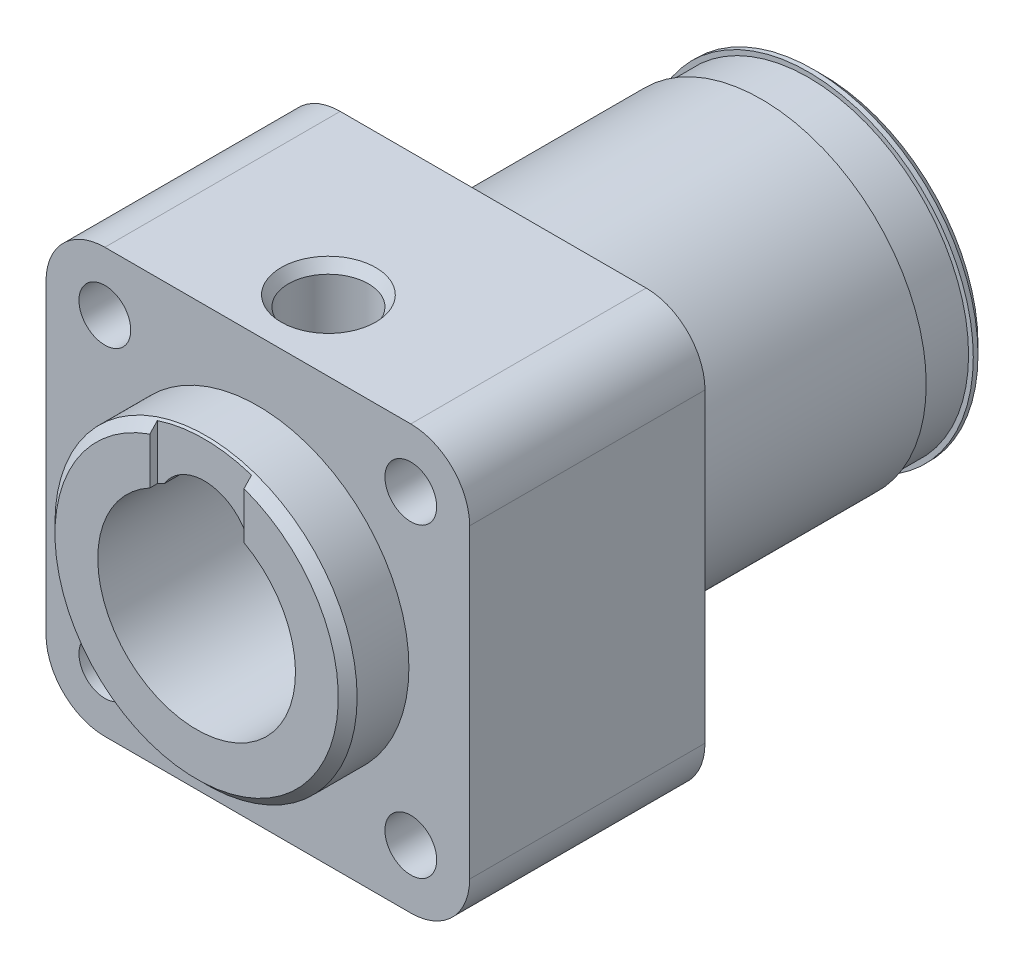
from build123d import *

# Parameters (mm, degrees)
ESQUISSE1_R                     = 30
BOSS_EXTRU_1_DEPTH              = 66.5
ESQUISSE2_W                     = 47.85022903
ESQUISSE2_H                     = 15.922106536
ESQUISSE2_W_2                   = 5
ESQUISSE2_H_2                   = 0.5
DIAM_TRE_DU_PER_AGE_21_0_21_1_D = 21
ESQUISSE5_R                     = 14.5
ENL_V_MAT_EXTRU_1_DEPTH         = 32
CHANFREIN1_SIZE                 = 1
ESQUISSE8_R                     = 36.23937647
ESQUISSE8_R_2                   = 16.05
ENL_V_MAT_EXTRU_2_DEPTH         = 6.5
CHANFREIN2_SIZE                 = 1
ESQUISSE9_W                     = 88.507356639
ESQUISSE9_H                     = 92.511260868
ENL_V_MAT_EXTRU_3_DEPTH         = 28.5
D_GAGEMENT_M51_D                = 5.5
TROU_TARAUD_M101_D              = 8.5
TROU_TARAUD_M101_DEPTH          = 17.5
TROU_TARAUD_M101_CSINK_D        = 10.05
TROU_TARAUD_M101_CSINK_ANGLE    = 70
TROU_TARAUD_M101_TIP            = 2.553657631
ENL_V_MAT_EXTRU_4_DEPTH         = 19
ESQUISSE17_W                    = 10
ESQUISSE17_H                    = 8.918440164
ENL_V_MAT_EXTRU_5_DEPTH         = 0.8


with BuildPart() as part:
    # Esquisse1 → Boss.-Extru.1 (new body)
    with BuildSketch(Plane.XY):
        Circle(ESQUISSE1_R)
    extrude(amount=BOSS_EXTRU_1_DEPTH)

    # Esquisse2 → Enl_vement de mati_re-R_volution1 (revolve, cut)
    with BuildSketch(Plane(origin=(0, 0, 0), x_dir=(0, 0, -1), z_dir=(1, 0, 0)), mode=Mode.PRIVATE) as enl_vement_de_mati_re_r_volution1_sk:
        with Locations((-11.074885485, 25.461053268)):
            Rectangle(ESQUISSE2_W, ESQUISSE2_H)
        with Locations((-4, 17.25)):
            Rectangle(ESQUISSE2_W_2, ESQUISSE2_H_2)
    revolve(enl_vement_de_mati_re_r_volution1_sk.sketch.rotate(Axis((0, 0, 66.5), (0, 0, -1)), 90), axis=Axis((0, 0, 66.5), (0, 0, -1)), mode=Mode.SUBTRACT)

    # Diam_tre du per_age _21.0 _21_1 (through all)
    with Locations(Plane(origin=(0, 0, 0), x_dir=(-1, 0, 0), z_dir=(0, 0, -1))):
        with Locations((0, 0)):
            Hole(DIAM_TRE_DU_PER_AGE_21_0_21_1_D / 2)

    # Esquisse5 → Enl_v. mat.-Extru.1 (cut)
    with BuildSketch(Plane(origin=(0, 0, 0), x_dir=(-1, 0, 0), z_dir=(0, 0, -1))):
        Circle(ESQUISSE5_R)
    extrude(amount=-ENL_V_MAT_EXTRU_1_DEPTH, mode=Mode.SUBTRACT)

    # Chanfrein1
    chanfrein1_edges = [part.edges().sort_by_distance(p)[0] for p in [
        (-17.5, 0, 0),
    ]]
    chamfer(chanfrein1_edges, length=CHANFREIN1_SIZE)

    # Esquisse8 → Enl_v. mat.-Extru.2 (cut)
    with BuildSketch(Plane.XY.offset(66.5)):
        Circle(ESQUISSE8_R)
        Circle(ESQUISSE8_R_2, mode=Mode.SUBTRACT)
    extrude(amount=-ENL_V_MAT_EXTRU_2_DEPTH, mode=Mode.SUBTRACT)

    # Chanfrein2
    chanfrein2_edges = [part.edges().sort_by_distance(p)[0] for p in [
        (-16.05, 0, 66.5),
    ]]
    chamfer(chanfrein2_edges, length=CHANFREIN2_SIZE)

    # Esquisse9 → Enl_v. mat.-Extru.3 (cut)
    with BuildSketch(Plane.XY.offset(60)):
        with Locations((-0.421463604, 1.053659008)):
            Rectangle(ESQUISSE9_W, ESQUISSE9_H)
        with BuildLine():
            Line((-16.25, 22.5), (16.25, 22.5))
            ThreePointArc((16.25, 22.5), (20.669417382, 20.669417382), (22.5, 16.25))
            Line((22.5, 16.25), (22.5, -16.25))
            ThreePointArc((22.5, -16.25), (20.669417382, -20.669417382), (16.25, -22.5))
            Line((16.25, -22.5), (-16.25, -22.5))
            ThreePointArc((-16.25, -22.5), (-20.669417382, -20.669417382), (-22.5, -16.25))
            Line((-22.5, -16.25), (-22.5, 16.25))
            ThreePointArc((-22.5, 16.25), (-20.669417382, 20.669417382), (-16.25, 22.5))
        make_face(mode=Mode.SUBTRACT)
    extrude(amount=-ENL_V_MAT_EXTRU_3_DEPTH, mode=Mode.SUBTRACT)

    # D_gagement M51 (through all)
    with Locations(Plane.XY.offset(60)):
        with Locations((-16.25, 16.25), (16.25, 16.25), (16.25, -16.25), (-16.25, -16.25)):
            Hole(D_GAGEMENT_M51_D / 2)

    # Trou taraud_ M101
    with Locations(Plane(origin=(0, 22.5, 0), x_dir=(-1, 0, 0), z_dir=(0, 1, 0))):
        with Locations((0, 52.5)):
            CounterSinkHole(TROU_TARAUD_M101_D / 2, TROU_TARAUD_M101_CSINK_D / 2, depth=TROU_TARAUD_M101_DEPTH, counter_sink_angle=TROU_TARAUD_M101_CSINK_ANGLE)
            with Locations((0, 0, -(TROU_TARAUD_M101_DEPTH + TROU_TARAUD_M101_TIP / 2))):  # 118° drill point
                Cone(0, TROU_TARAUD_M101_D / 2, TROU_TARAUD_M101_TIP, mode=Mode.SUBTRACT)

    # Esquisse16 → Enl_v. mat.-Extru.4 (cut)
    with BuildSketch(Plane.XY.offset(66.5)):
        with BuildLine():
            Line((-4.25, 9.601432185), (4.304636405, 9.577061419))
            ThreePointArc((4.304636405, 9.577061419), (0.034185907, 11.999951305), (-4.25, 9.601432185))
        make_face()
    extrude(amount=-ENL_V_MAT_EXTRU_4_DEPTH, mode=Mode.SUBTRACT)

    # Esquisse17 → Enl_v. mat.-Extru.5 (cut)
    with BuildSketch(Plane.XY.offset(66.5)):
        with Locations((0.029912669, 12.448218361)):
            Rectangle(ESQUISSE17_W, ESQUISSE17_H)
    extrude(amount=-ENL_V_MAT_EXTRU_5_DEPTH, mode=Mode.SUBTRACT)


solid = part.part
